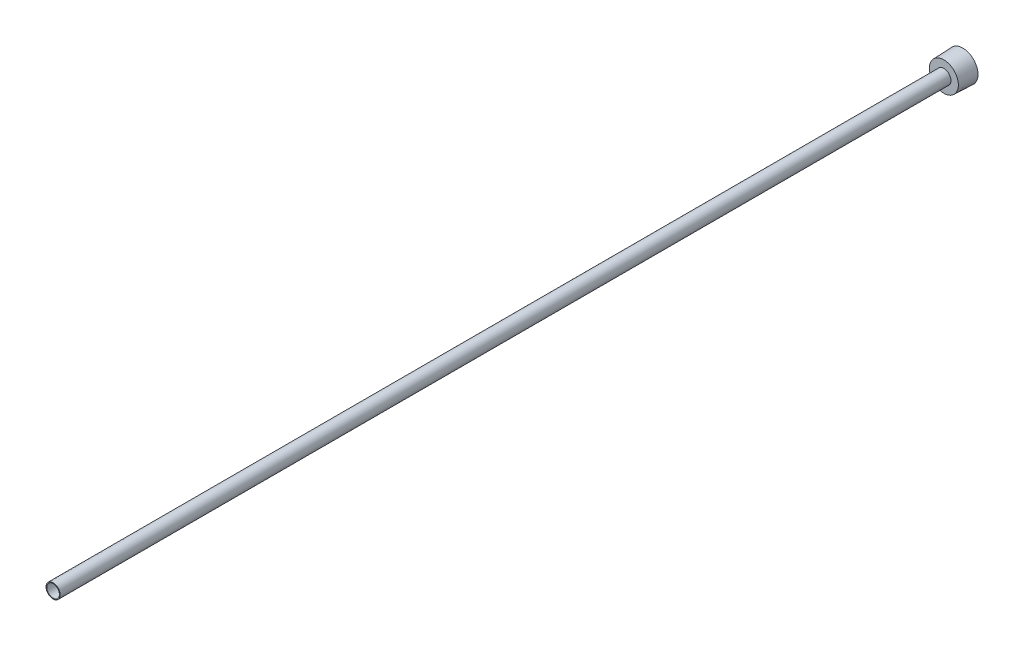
ISO-10303-21;
HEADER;
FILE_DESCRIPTION(('STEP AP214'),'2;1');
FILE_NAME('part.step','',(''),(''),'','','');
FILE_SCHEMA(('AUTOMOTIVE_DESIGN { 1 0 10303 214 1 1 1 1 }'));
ENDSEC;
DATA;
#1=APPLICATION_CONTEXT('core data for automotive mechanical design processes');
#2=APPLICATION_PROTOCOL_DEFINITION('international standard','automotive_design',2000,#1);
#3=PRODUCT_CONTEXT('',#1,'mechanical');
#4=PRODUCT('Part','Part','',(#3));
#5=PRODUCT_RELATED_PRODUCT_CATEGORY('part','',(#4));
#6=PRODUCT_DEFINITION_FORMATION('','',#4);
#7=PRODUCT_DEFINITION_CONTEXT('part definition',#1,'design');
#8=PRODUCT_DEFINITION('design','',#6,#7);
#9=PRODUCT_DEFINITION_SHAPE('','',#8);
#10=(LENGTH_UNIT() NAMED_UNIT(*) SI_UNIT(.MILLI.,.METRE.));
#11=(NAMED_UNIT(*) PLANE_ANGLE_UNIT() SI_UNIT($,.RADIAN.));
#12=(NAMED_UNIT(*) SI_UNIT($,.STERADIAN.) SOLID_ANGLE_UNIT());
#13=UNCERTAINTY_MEASURE_WITH_UNIT(LENGTH_MEASURE(1.E-05),#10,'distance_accuracy_value','');
#14=(GEOMETRIC_REPRESENTATION_CONTEXT(3) GLOBAL_UNCERTAINTY_ASSIGNED_CONTEXT((#13)) GLOBAL_UNIT_ASSIGNED_CONTEXT((#10,
#11,#12)) REPRESENTATION_CONTEXT('',''));
#15=CARTESIAN_POINT('',(0.,0.,0.));
#16=DIRECTION('',(0.,0.,1.));
#17=DIRECTION('',(1.,0.,0.));
#18=AXIS2_PLACEMENT_3D('',#15,#16,#17);
#19=CARTESIAN_POINT('',(0.,0.,0.));
#20=DIRECTION('',(0.,0.,1.));
#21=DIRECTION('',(1.,0.,0.));
#22=AXIS2_PLACEMENT_3D('',#19,#20,#21);
#23=CYLINDRICAL_SURFACE('',#22,2.1209);
#24=CARTESIAN_POINT('',(0.,0.,304.8));
#25=DIRECTION('',(0.,0.,1.));
#26=DIRECTION('',(1.,0.,0.));
#27=AXIS2_PLACEMENT_3D('',#24,#25,#26);
#28=CIRCLE('',#27,2.1209);
#29=CARTESIAN_POINT('',(2.1209,0.,304.8));
#30=VERTEX_POINT('',#29);
#31=EDGE_CURVE('E142',#30,#30,#28,.T.);
#32=CARTESIAN_POINT('',(0.,0.,4.7625));
#33=DIRECTION('',(0.,0.,-1.));
#34=DIRECTION('',(0.,1.,0.));
#35=AXIS2_PLACEMENT_3D('',#32,#33,#34);
#36=CIRCLE('',#35,2.1209);
#37=CARTESIAN_POINT('',(2.1209,0.,4.7625));
#38=VERTEX_POINT('',#37);
#39=EDGE_CURVE('E37',#38,#38,#36,.F.);
#40=CARTESIAN_POINT('',(2.1209,0.,304.8));
#41=CARTESIAN_POINT('',(2.1209,0.,301.674609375));
#42=CARTESIAN_POINT('',(2.1209,0.,298.54921875));
#43=CARTESIAN_POINT('',(2.1209,0.,292.2984375));
#44=CARTESIAN_POINT('',(2.1209,0.,289.173046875));
#45=CARTESIAN_POINT('',(2.1209,0.,282.922265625));
#46=CARTESIAN_POINT('',(2.1209,0.,279.796875));
#47=CARTESIAN_POINT('',(2.1209,0.,273.54609375));
#48=CARTESIAN_POINT('',(2.1209,0.,270.420703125));
#49=CARTESIAN_POINT('',(2.1209,0.,264.169921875));
#50=CARTESIAN_POINT('',(2.1209,0.,261.04453125));
#51=CARTESIAN_POINT('',(2.1209,0.,254.79375));
#52=CARTESIAN_POINT('',(2.1209,0.,251.668359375));
#53=CARTESIAN_POINT('',(2.1209,0.,245.417578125));
#54=CARTESIAN_POINT('',(2.1209,0.,242.2921875));
#55=CARTESIAN_POINT('',(2.1209,0.,236.04140625));
#56=CARTESIAN_POINT('',(2.1209,0.,232.916015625));
#57=CARTESIAN_POINT('',(2.1209,0.,226.665234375));
#58=CARTESIAN_POINT('',(2.1209,0.,223.53984375));
#59=CARTESIAN_POINT('',(2.1209,0.,217.2890625));
#60=CARTESIAN_POINT('',(2.1209,0.,214.163671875));
#61=CARTESIAN_POINT('',(2.1209,0.,207.912890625));
#62=CARTESIAN_POINT('',(2.1209,0.,204.7875));
#63=CARTESIAN_POINT('',(2.1209,0.,198.53671875));
#64=CARTESIAN_POINT('',(2.1209,0.,195.411328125));
#65=CARTESIAN_POINT('',(2.1209,0.,189.160546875));
#66=CARTESIAN_POINT('',(2.1209,0.,186.03515625));
#67=CARTESIAN_POINT('',(2.1209,0.,179.784375));
#68=CARTESIAN_POINT('',(2.1209,0.,176.658984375));
#69=CARTESIAN_POINT('',(2.1209,0.,170.408203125));
#70=CARTESIAN_POINT('',(2.1209,0.,167.2828125));
#71=CARTESIAN_POINT('',(2.1209,0.,161.03203125));
#72=CARTESIAN_POINT('',(2.1209,0.,157.906640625));
#73=CARTESIAN_POINT('',(2.1209,0.,151.655859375));
#74=CARTESIAN_POINT('',(2.1209,0.,148.53046875));
#75=CARTESIAN_POINT('',(2.1209,0.,142.2796875));
#76=CARTESIAN_POINT('',(2.1209,0.,139.154296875));
#77=CARTESIAN_POINT('',(2.1209,0.,132.903515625));
#78=CARTESIAN_POINT('',(2.1209,0.,129.778125));
#79=CARTESIAN_POINT('',(2.1209,0.,123.52734375));
#80=CARTESIAN_POINT('',(2.1209,0.,120.401953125));
#81=CARTESIAN_POINT('',(2.1209,0.,114.151171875));
#82=CARTESIAN_POINT('',(2.1209,0.,111.02578125));
#83=CARTESIAN_POINT('',(2.1209,0.,104.775));
#84=CARTESIAN_POINT('',(2.1209,0.,101.649609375));
#85=CARTESIAN_POINT('',(2.1209,0.,95.398828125));
#86=CARTESIAN_POINT('',(2.1209,0.,92.2734375));
#87=CARTESIAN_POINT('',(2.1209,0.,86.02265625));
#88=CARTESIAN_POINT('',(2.1209,0.,82.897265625));
#89=CARTESIAN_POINT('',(2.1209,0.,76.646484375));
#90=CARTESIAN_POINT('',(2.1209,0.,73.52109375));
#91=CARTESIAN_POINT('',(2.1209,0.,67.2703125));
#92=CARTESIAN_POINT('',(2.1209,0.,64.144921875));
#93=CARTESIAN_POINT('',(2.1209,0.,57.894140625));
#94=CARTESIAN_POINT('',(2.1209,0.,54.76875));
#95=CARTESIAN_POINT('',(2.1209,0.,48.51796875));
#96=CARTESIAN_POINT('',(2.1209,0.,45.392578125));
#97=CARTESIAN_POINT('',(2.1209,0.,39.141796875));
#98=CARTESIAN_POINT('',(2.1209,0.,36.01640625));
#99=CARTESIAN_POINT('',(2.1209,0.,29.765625));
#100=CARTESIAN_POINT('',(2.1209,0.,26.640234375));
#101=CARTESIAN_POINT('',(2.1209,0.,20.389453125));
#102=CARTESIAN_POINT('',(2.1209,0.,17.2640625));
#103=CARTESIAN_POINT('',(2.1209,0.,11.01328125));
#104=CARTESIAN_POINT('',(2.1209,0.,7.887890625));
#105=CARTESIAN_POINT('',(2.1209,0.,4.7625));
#106=B_SPLINE_CURVE_WITH_KNOTS('',3,(#40,#41,#42,#43,#44,#45,#46,#47,#48,#49,#50,#51,#52,#53,
#54,#55,#56,#57,#58,#59,#60,#61,#62,#63,#64,#65,#66,#67,#68,#69,#70,#71,#72,#73,#74,#75,#76,#77,
#78,#79,#80,#81,#82,#83,#84,#85,#86,#87,#88,#89,#90,#91,#92,#93,#94,#95,#96,#97,#98,#99,#100,
#101,#102,#103,#104,#105),.UNSPECIFIED.,.F.,.F.,(4,2,2,2,2,2,2,2,2,2,2,2,2,2,2,2,2,2,2,2,2,2,2,
2,2,2,2,2,2,2,2,2,4),(0.,9.37617187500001,18.75234375,28.128515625,37.5046875,46.880859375,
56.25703125,65.633203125,75.009375,84.385546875,93.76171875,103.137890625,112.5140625,
121.890234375,131.26640625,140.642578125,150.01875,159.394921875,168.77109375,178.147265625,
187.5234375,196.899609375,206.27578125,215.651953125,225.028125,234.404296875,243.78046875,
253.156640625,262.5328125,271.908984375,281.28515625,290.661328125,300.0375),.UNSPECIFIED.);
#107=EDGE_CURVE('BSEAM33',#30,#38,#106,.T.);
#108=ORIENTED_EDGE('',*,*,#31,.T.);
#109=ORIENTED_EDGE('',*,*,#39,.F.);
#110=ORIENTED_EDGE('',*,*,#107,.T.);
#111=ORIENTED_EDGE('',*,*,#107,.F.);
#112=EDGE_LOOP('',(#108,#110,#109,#111));
#113=FACE_BOUND('',#112,.T.);
#114=ADVANCED_FACE('F33',(#113),#23,.F.);
#115=CARTESIAN_POINT('',(0.,0.,0.));
#116=DIRECTION('',(0.,0.,1.));
#117=DIRECTION('',(0.,-1.,0.));
#118=AXIS2_PLACEMENT_3D('',#115,#116,#117);
#119=PLANE('',#118);
#120=DIRECTION('',(-0.866025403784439,0.5,0.));
#121=VECTOR('',#120,1.);
#122=CARTESIAN_POINT('',(0.,-3.66617420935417,0.));
#123=LINE('',#122,#121);
#124=CARTESIAN_POINT('',(0.,-3.66617420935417,0.));
#125=VERTEX_POINT('',#124);
#126=CARTESIAN_POINT('',(-3.175,-1.83308710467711,0.));
#127=VERTEX_POINT('',#126);
#128=EDGE_CURVE('E124',#125,#127,#123,.T.);
#129=ORIENTED_EDGE('',*,*,#128,.F.);
#130=DIRECTION('',(-0.866025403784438,-0.500000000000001,0.));
#131=VECTOR('',#130,1.);
#132=CARTESIAN_POINT('',(3.175,-1.83308710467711,0.));
#133=LINE('',#132,#131);
#134=CARTESIAN_POINT('',(3.175,-1.83308710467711,0.));
#135=VERTEX_POINT('',#134);
#136=EDGE_CURVE('E49',#135,#125,#133,.T.);
#137=ORIENTED_EDGE('',*,*,#136,.F.);
#138=DIRECTION('',(0.,-1.,0.));
#139=VECTOR('',#138,1.);
#140=CARTESIAN_POINT('',(3.175,1.83308710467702,0.));
#141=LINE('',#140,#139);
#142=CARTESIAN_POINT('',(3.175,1.83308710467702,0.));
#143=VERTEX_POINT('',#142);
#144=EDGE_CURVE('E133',#143,#135,#141,.T.);
#145=ORIENTED_EDGE('',*,*,#144,.F.);
#146=DIRECTION('',(0.866025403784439,-0.5,0.));
#147=VECTOR('',#146,1.);
#148=CARTESIAN_POINT('',(0.,3.66617420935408,0.));
#149=LINE('',#148,#147);
#150=CARTESIAN_POINT('',(0.,3.66617420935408,0.));
#151=VERTEX_POINT('',#150);
#152=EDGE_CURVE('E131',#151,#143,#149,.T.);
#153=ORIENTED_EDGE('',*,*,#152,.F.);
#154=DIRECTION('',(0.866025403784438,0.5,0.));
#155=VECTOR('',#154,1.);
#156=CARTESIAN_POINT('',(-3.175,1.83308710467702,0.));
#157=LINE('',#156,#155);
#158=CARTESIAN_POINT('',(-3.175,1.83308710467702,0.));
#159=VERTEX_POINT('',#158);
#160=EDGE_CURVE('E97',#159,#151,#157,.T.);
#161=ORIENTED_EDGE('',*,*,#160,.F.);
#162=DIRECTION('',(0.,1.,0.));
#163=VECTOR('',#162,1.);
#164=CARTESIAN_POINT('',(-3.175,-1.83308710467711,0.));
#165=LINE('',#164,#163);
#166=EDGE_CURVE('E127',#127,#159,#165,.T.);
#167=ORIENTED_EDGE('',*,*,#166,.F.);
#168=EDGE_LOOP('',(#129,#137,#145,#153,#161,#167));
#169=FACE_BOUND('',#168,.T.);
#170=CARTESIAN_POINT('',(0.,0.,0.));
#171=DIRECTION('',(0.,0.,1.));
#172=DIRECTION('',(0.,-1.,0.));
#173=AXIS2_PLACEMENT_3D('',#170,#171,#172);
#174=CIRCLE('',#173,5.09270000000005);
#175=CARTESIAN_POINT('',(0.,-5.09270000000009,0.));
#176=VERTEX_POINT('',#175);
#177=EDGE_CURVE('E11',#176,#176,#174,.T.);
#178=ORIENTED_EDGE('',*,*,#177,.F.);
#179=EDGE_LOOP('',(#178));
#180=FACE_BOUND('',#179,.T.);
#181=ADVANCED_FACE('F35',(#169,#180),#119,.F.);
#182=CARTESIAN_POINT('',(0.,0.,0.));
#183=DIRECTION('',(0.,0.,-1.));
#184=DIRECTION('',(0.,1.,0.));
#185=AXIS2_PLACEMENT_3D('',#182,#183,#184);
#186=CONICAL_SURFACE('',#185,5.09270000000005,0.0364599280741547);
#187=CARTESIAN_POINT('',(0.,0.,6.35));
#188=DIRECTION('',(0.,0.,1.));
#189=DIRECTION('',(0.,-1.,0.));
#190=AXIS2_PLACEMENT_3D('',#187,#188,#189);
#191=CIRCLE('',#190,4.86107681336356);
#192=CARTESIAN_POINT('',(0.,-4.86107681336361,6.35));
#193=VERTEX_POINT('',#192);
#194=EDGE_CURVE('E42',#193,#193,#191,.T.);
#195=ORIENTED_EDGE('',*,*,#194,.F.);
#196=EDGE_LOOP('',(#195));
#197=FACE_BOUND('',#196,.T.);
#198=ORIENTED_EDGE('',*,*,#177,.T.);
#199=EDGE_LOOP('',(#198));
#200=FACE_BOUND('',#199,.T.);
#201=ADVANCED_FACE('F156',(#197,#200),#186,.T.);
#202=CARTESIAN_POINT('',(0.,4.86107681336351,6.35));
#203=DIRECTION('',(0.,0.,-1.));
#204=DIRECTION('',(0.,1.,0.));
#205=AXIS2_PLACEMENT_3D('',#202,#203,#204);
#206=PLANE('',#205);
#207=CARTESIAN_POINT('',(0.,0.,6.35));
#208=DIRECTION('',(0.,0.,1.));
#209=DIRECTION('',(0.,-1.,0.));
#210=AXIS2_PLACEMENT_3D('',#207,#208,#209);
#211=CIRCLE('',#210,2.37490000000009);
#212=CARTESIAN_POINT('',(0.,-2.37490000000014,6.35));
#213=VERTEX_POINT('',#212);
#214=EDGE_CURVE('E148',#213,#213,#211,.T.);
#215=ORIENTED_EDGE('',*,*,#214,.F.);
#216=EDGE_LOOP('',(#215));
#217=FACE_BOUND('',#216,.T.);
#218=ORIENTED_EDGE('',*,*,#194,.T.);
#219=EDGE_LOOP('',(#218));
#220=FACE_BOUND('',#219,.T.);
#221=ADVANCED_FACE('F154',(#217,#220),#206,.F.);
#222=CARTESIAN_POINT('',(0.,0.,0.));
#223=DIRECTION('',(0.,0.,1.));
#224=DIRECTION('',(0.,-1.,0.));
#225=AXIS2_PLACEMENT_3D('',#222,#223,#224);
#226=CYLINDRICAL_SURFACE('',#225,2.37490000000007);
#227=CARTESIAN_POINT('',(0.,0.,304.8));
#228=DIRECTION('',(0.,0.,1.));
#229=DIRECTION('',(0.,-1.,0.));
#230=AXIS2_PLACEMENT_3D('',#227,#228,#229);
#231=CIRCLE('',#230,2.37490000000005);
#232=CARTESIAN_POINT('',(0.,-2.37490000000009,304.8));
#233=VERTEX_POINT('',#232);
#234=EDGE_CURVE('E145',#233,#233,#231,.T.);
#235=ORIENTED_EDGE('',*,*,#234,.F.);
#236=EDGE_LOOP('',(#235));
#237=FACE_BOUND('',#236,.T.);
#238=ORIENTED_EDGE('',*,*,#214,.T.);
#239=EDGE_LOOP('',(#238));
#240=FACE_BOUND('',#239,.T.);
#241=ADVANCED_FACE('F190',(#237,#240),#226,.T.);
#242=CARTESIAN_POINT('',(0.,2.3749,304.8));
#243=DIRECTION('',(0.,0.,-1.));
#244=DIRECTION('',(0.,1.,0.));
#245=AXIS2_PLACEMENT_3D('',#242,#243,#244);
#246=PLANE('',#245);
#247=ORIENTED_EDGE('',*,*,#31,.F.);
#248=EDGE_LOOP('',(#247));
#249=FACE_BOUND('',#248,.T.);
#250=ORIENTED_EDGE('',*,*,#234,.T.);
#251=EDGE_LOOP('',(#250));
#252=FACE_BOUND('',#251,.T.);
#253=ADVANCED_FACE('F183',(#249,#252),#246,.F.);
#254=CARTESIAN_POINT('',(0.,-3.66617420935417,4.7625));
#255=DIRECTION('',(0.,0.,-1.));
#256=DIRECTION('',(0.,1.,0.));
#257=AXIS2_PLACEMENT_3D('',#254,#255,#256);
#258=PLANE('',#257);
#259=DIRECTION('',(-0.866025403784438,-0.500000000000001,0.));
#260=VECTOR('',#259,1.);
#261=CARTESIAN_POINT('',(3.175,-1.83308710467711,4.7625));
#262=LINE('',#261,#260);
#263=CARTESIAN_POINT('',(3.175,-1.83308710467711,4.7625));
#264=VERTEX_POINT('',#263);
#265=CARTESIAN_POINT('',(0.,-3.66617420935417,4.7625));
#266=VERTEX_POINT('',#265);
#267=EDGE_CURVE('E135',#264,#266,#262,.T.);
#268=ORIENTED_EDGE('',*,*,#267,.T.);
#269=DIRECTION('',(-0.866025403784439,0.5,0.));
#270=VECTOR('',#269,1.);
#271=CARTESIAN_POINT('',(0.,-3.66617420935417,4.7625));
#272=LINE('',#271,#270);
#273=CARTESIAN_POINT('',(-3.175,-1.83308710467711,4.7625));
#274=VERTEX_POINT('',#273);
#275=EDGE_CURVE('E118',#266,#274,#272,.T.);
#276=ORIENTED_EDGE('',*,*,#275,.T.);
#277=DIRECTION('',(0.,1.,0.));
#278=VECTOR('',#277,1.);
#279=CARTESIAN_POINT('',(-3.175,-1.83308710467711,4.7625));
#280=LINE('',#279,#278);
#281=CARTESIAN_POINT('',(-3.175,1.83308710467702,4.7625));
#282=VERTEX_POINT('',#281);
#283=EDGE_CURVE('E116',#274,#282,#280,.T.);
#284=ORIENTED_EDGE('',*,*,#283,.T.);
#285=DIRECTION('',(0.866025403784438,0.5,0.));
#286=VECTOR('',#285,1.);
#287=CARTESIAN_POINT('',(-3.175,1.83308710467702,4.7625));
#288=LINE('',#287,#286);
#289=CARTESIAN_POINT('',(0.,3.66617420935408,4.7625));
#290=VERTEX_POINT('',#289);
#291=EDGE_CURVE('E94',#282,#290,#288,.T.);
#292=ORIENTED_EDGE('',*,*,#291,.T.);
#293=DIRECTION('',(0.866025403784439,-0.5,0.));
#294=VECTOR('',#293,1.);
#295=CARTESIAN_POINT('',(0.,3.66617420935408,4.7625));
#296=LINE('',#295,#294);
#297=CARTESIAN_POINT('',(3.175,1.83308710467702,4.7625));
#298=VERTEX_POINT('',#297);
#299=EDGE_CURVE('E105',#290,#298,#296,.T.);
#300=ORIENTED_EDGE('',*,*,#299,.T.);
#301=DIRECTION('',(0.,-1.,0.));
#302=VECTOR('',#301,1.);
#303=CARTESIAN_POINT('',(3.175,1.83308710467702,4.7625));
#304=LINE('',#303,#302);
#305=EDGE_CURVE('E109',#298,#264,#304,.T.);
#306=ORIENTED_EDGE('',*,*,#305,.T.);
#307=EDGE_LOOP('',(#268,#276,#284,#292,#300,#306));
#308=FACE_BOUND('',#307,.T.);
#309=ORIENTED_EDGE('',*,*,#39,.T.);
#310=EDGE_LOOP('',(#309));
#311=FACE_BOUND('',#310,.T.);
#312=ADVANCED_FACE('F112',(#308,#311),#258,.T.);
#313=CARTESIAN_POINT('',(3.175,-1.83308710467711,4.7625));
#314=DIRECTION('',(0.5,-0.866025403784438,0.));
#315=DIRECTION('',(0.866025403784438,0.5,0.));
#316=AXIS2_PLACEMENT_3D('',#313,#314,#315);
#317=PLANE('',#316);
#318=ORIENTED_EDGE('',*,*,#136,.T.);
#319=DIRECTION('',(0.,0.,-1.));
#320=VECTOR('',#319,1.);
#321=CARTESIAN_POINT('',(0.,-3.66617420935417,4.7625));
#322=LINE('',#321,#320);
#323=EDGE_CURVE('E79',#266,#125,#322,.T.);
#324=ORIENTED_EDGE('',*,*,#323,.F.);
#325=ORIENTED_EDGE('',*,*,#267,.F.);
#326=DIRECTION('',(0.,0.,-1.));
#327=VECTOR('',#326,1.);
#328=CARTESIAN_POINT('',(3.175,-1.83308710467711,4.7625));
#329=LINE('',#328,#327);
#330=EDGE_CURVE('E57',#264,#135,#329,.T.);
#331=ORIENTED_EDGE('',*,*,#330,.T.);
#332=EDGE_LOOP('',(#318,#324,#325,#331));
#333=FACE_BOUND('',#332,.T.);
#334=ADVANCED_FACE('F174',(#333),#317,.F.);
#335=CARTESIAN_POINT('',(3.175,1.83308710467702,4.7625));
#336=DIRECTION('',(1.,0.,0.));
#337=DIRECTION('',(0.,1.,0.));
#338=AXIS2_PLACEMENT_3D('',#335,#336,#337);
#339=PLANE('',#338);
#340=ORIENTED_EDGE('',*,*,#144,.T.);
#341=ORIENTED_EDGE('',*,*,#330,.F.);
#342=ORIENTED_EDGE('',*,*,#305,.F.);
#343=DIRECTION('',(0.,0.,-1.));
#344=VECTOR('',#343,1.);
#345=CARTESIAN_POINT('',(3.175,1.83308710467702,4.7625));
#346=LINE('',#345,#344);
#347=EDGE_CURVE('E101',#298,#143,#346,.T.);
#348=ORIENTED_EDGE('',*,*,#347,.T.);
#349=EDGE_LOOP('',(#340,#341,#342,#348));
#350=FACE_BOUND('',#349,.T.);
#351=ADVANCED_FACE('F176',(#350),#339,.F.);
#352=CARTESIAN_POINT('',(0.,3.66617420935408,4.7625));
#353=DIRECTION('',(0.5,0.866025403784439,0.));
#354=DIRECTION('',(-0.866025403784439,0.5,0.));
#355=AXIS2_PLACEMENT_3D('',#352,#353,#354);
#356=PLANE('',#355);
#357=ORIENTED_EDGE('',*,*,#152,.T.);
#358=ORIENTED_EDGE('',*,*,#347,.F.);
#359=ORIENTED_EDGE('',*,*,#299,.F.);
#360=DIRECTION('',(0.,0.,-1.));
#361=VECTOR('',#360,1.);
#362=CARTESIAN_POINT('',(0.,3.66617420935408,4.7625));
#363=LINE('',#362,#361);
#364=EDGE_CURVE('E90',#290,#151,#363,.T.);
#365=ORIENTED_EDGE('',*,*,#364,.T.);
#366=EDGE_LOOP('',(#357,#358,#359,#365));
#367=FACE_BOUND('',#366,.T.);
#368=ADVANCED_FACE('F106',(#367),#356,.F.);
#369=CARTESIAN_POINT('',(-3.175,1.83308710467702,4.7625));
#370=DIRECTION('',(-0.5,0.866025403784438,0.));
#371=DIRECTION('',(-0.866025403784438,-0.5,0.));
#372=AXIS2_PLACEMENT_3D('',#369,#370,#371);
#373=PLANE('',#372);
#374=ORIENTED_EDGE('',*,*,#160,.T.);
#375=ORIENTED_EDGE('',*,*,#364,.F.);
#376=ORIENTED_EDGE('',*,*,#291,.F.);
#377=DIRECTION('',(0.,0.,-1.));
#378=VECTOR('',#377,1.);
#379=CARTESIAN_POINT('',(-3.175,1.83308710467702,4.7625));
#380=LINE('',#379,#378);
#381=EDGE_CURVE('E102',#282,#159,#380,.T.);
#382=ORIENTED_EDGE('',*,*,#381,.T.);
#383=EDGE_LOOP('',(#374,#375,#376,#382));
#384=FACE_BOUND('',#383,.T.);
#385=ADVANCED_FACE('F92',(#384),#373,.F.);
#386=CARTESIAN_POINT('',(-3.175,-1.83308710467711,4.7625));
#387=DIRECTION('',(-1.,0.,0.));
#388=DIRECTION('',(0.,-1.,0.));
#389=AXIS2_PLACEMENT_3D('',#386,#387,#388);
#390=PLANE('',#389);
#391=ORIENTED_EDGE('',*,*,#166,.T.);
#392=ORIENTED_EDGE('',*,*,#381,.F.);
#393=ORIENTED_EDGE('',*,*,#283,.F.);
#394=DIRECTION('',(0.,0.,-1.));
#395=VECTOR('',#394,1.);
#396=CARTESIAN_POINT('',(-3.175,-1.83308710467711,4.7625));
#397=LINE('',#396,#395);
#398=EDGE_CURVE('E139',#274,#127,#397,.T.);
#399=ORIENTED_EDGE('',*,*,#398,.T.);
#400=EDGE_LOOP('',(#391,#392,#393,#399));
#401=FACE_BOUND('',#400,.T.);
#402=ADVANCED_FACE('F246',(#401),#390,.F.);
#403=CARTESIAN_POINT('',(0.,-3.66617420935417,4.7625));
#404=DIRECTION('',(-0.5,-0.866025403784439,0.));
#405=DIRECTION('',(0.866025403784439,-0.5,0.));
#406=AXIS2_PLACEMENT_3D('',#403,#404,#405);
#407=PLANE('',#406);
#408=ORIENTED_EDGE('',*,*,#128,.T.);
#409=ORIENTED_EDGE('',*,*,#398,.F.);
#410=ORIENTED_EDGE('',*,*,#275,.F.);
#411=ORIENTED_EDGE('',*,*,#323,.T.);
#412=EDGE_LOOP('',(#408,#409,#410,#411));
#413=FACE_BOUND('',#412,.T.);
#414=ADVANCED_FACE('F172',(#413),#407,.F.);
#415=CLOSED_SHELL('',(#114,#181,#201,#221,#241,#253,#312,#334,#351,#368,#385,#402,#414));
#416=MANIFOLD_SOLID_BREP('B2',#415);
#417=ADVANCED_BREP_SHAPE_REPRESENTATION('',(#18,#416),#14);
#418=SHAPE_DEFINITION_REPRESENTATION(#9,#417);
ENDSEC;
END-ISO-10303-21;
